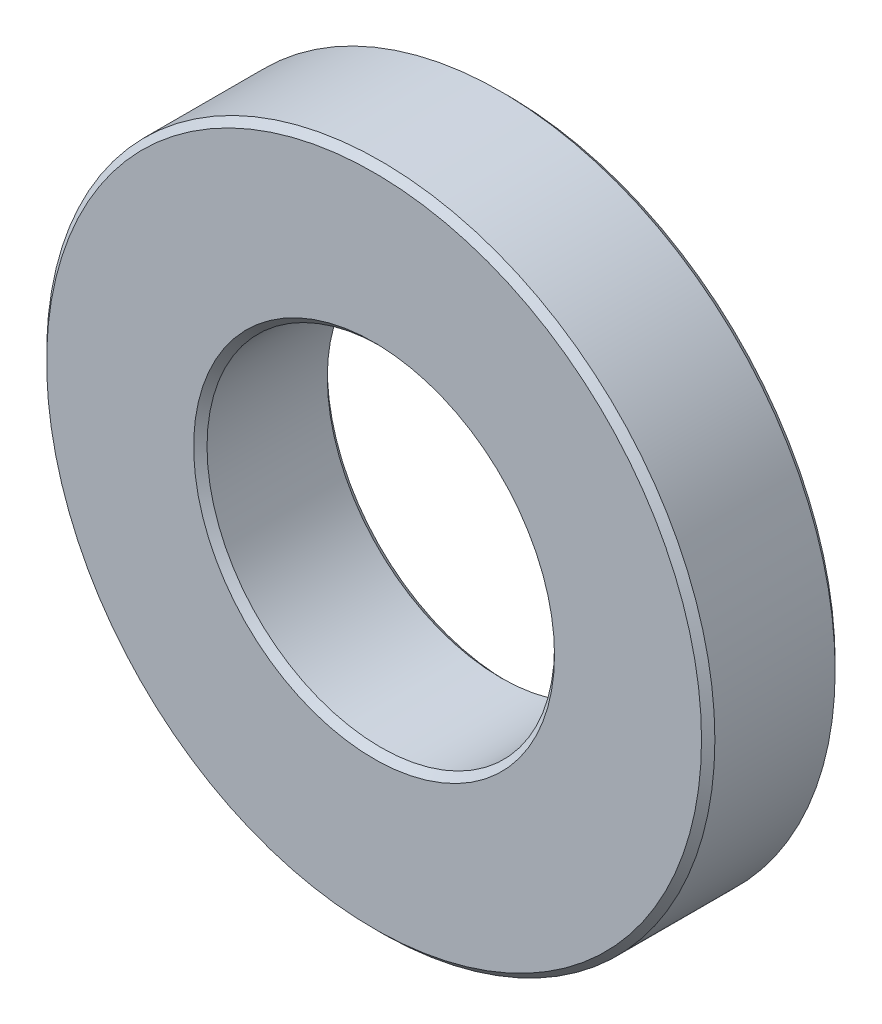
ISO-10303-21;
HEADER;
FILE_DESCRIPTION(('STEP AP214'),'2;1');
FILE_NAME('part.step','',(''),(''),'','','');
FILE_SCHEMA(('AUTOMOTIVE_DESIGN { 1 0 10303 214 1 1 1 1 }'));
ENDSEC;
DATA;
#1=APPLICATION_CONTEXT('core data for automotive mechanical design processes');
#2=APPLICATION_PROTOCOL_DEFINITION('international standard','automotive_design',2000,#1);
#3=PRODUCT_CONTEXT('',#1,'mechanical');
#4=PRODUCT('Part','Part','',(#3));
#5=PRODUCT_RELATED_PRODUCT_CATEGORY('part','',(#4));
#6=PRODUCT_DEFINITION_FORMATION('','',#4);
#7=PRODUCT_DEFINITION_CONTEXT('part definition',#1,'design');
#8=PRODUCT_DEFINITION('design','',#6,#7);
#9=PRODUCT_DEFINITION_SHAPE('','',#8);
#10=(LENGTH_UNIT() NAMED_UNIT(*) SI_UNIT(.MILLI.,.METRE.));
#11=(NAMED_UNIT(*) PLANE_ANGLE_UNIT() SI_UNIT($,.RADIAN.));
#12=(NAMED_UNIT(*) SI_UNIT($,.STERADIAN.) SOLID_ANGLE_UNIT());
#13=UNCERTAINTY_MEASURE_WITH_UNIT(LENGTH_MEASURE(1.E-05),#10,'distance_accuracy_value','');
#14=(GEOMETRIC_REPRESENTATION_CONTEXT(3) GLOBAL_UNCERTAINTY_ASSIGNED_CONTEXT((#13)) GLOBAL_UNIT_ASSIGNED_CONTEXT((#10,
#11,#12)) REPRESENTATION_CONTEXT('',''));
#15=CARTESIAN_POINT('',(0.,0.,0.));
#16=DIRECTION('',(0.,0.,1.));
#17=DIRECTION('',(1.,0.,0.));
#18=AXIS2_PLACEMENT_3D('',#15,#16,#17);
#19=CARTESIAN_POINT('',(0.,0.,1.));
#20=DIRECTION('',(0.,0.,1.));
#21=DIRECTION('',(1.,0.,0.));
#22=AXIS2_PLACEMENT_3D('',#19,#20,#21);
#23=PLANE('',#22);
#24=CARTESIAN_POINT('',(0.,0.,1.));
#25=DIRECTION('',(0.,0.,1.));
#26=DIRECTION('',(1.,0.,0.));
#27=AXIS2_PLACEMENT_3D('',#24,#25,#26);
#28=CIRCLE('',#27,2.7);
#29=CARTESIAN_POINT('',(2.7,0.,1.));
#30=VERTEX_POINT('',#29);
#31=EDGE_CURVE('E10',#30,#30,#28,.F.);
#32=ORIENTED_EDGE('',*,*,#31,.T.);
#33=EDGE_LOOP('',(#32));
#34=FACE_BOUND('',#33,.T.);
#35=CARTESIAN_POINT('',(0.,0.,1.));
#36=DIRECTION('',(0.,0.,1.));
#37=DIRECTION('',(1.,0.,0.));
#38=AXIS2_PLACEMENT_3D('',#35,#36,#37);
#39=CIRCLE('',#38,4.9);
#40=CARTESIAN_POINT('',(4.9,0.,1.));
#41=VERTEX_POINT('',#40);
#42=EDGE_CURVE('E45',#41,#41,#39,.T.);
#43=ORIENTED_EDGE('',*,*,#42,.T.);
#44=EDGE_LOOP('',(#43));
#45=FACE_BOUND('',#44,.T.);
#46=ADVANCED_FACE('F37',(#34,#45),#23,.T.);
#47=CARTESIAN_POINT('',(0.,0.,-1.));
#48=DIRECTION('',(0.,0.,1.));
#49=DIRECTION('',(1.,0.,0.));
#50=AXIS2_PLACEMENT_3D('',#47,#48,#49);
#51=PLANE('',#50);
#52=CARTESIAN_POINT('',(0.,0.,-1.));
#53=DIRECTION('',(0.,0.,1.));
#54=DIRECTION('',(1.,0.,0.));
#55=AXIS2_PLACEMENT_3D('',#52,#53,#54);
#56=CIRCLE('',#55,4.9);
#57=CARTESIAN_POINT('',(4.9,0.,-1.));
#58=VERTEX_POINT('',#57);
#59=EDGE_CURVE('E63',#58,#58,#56,.F.);
#60=ORIENTED_EDGE('',*,*,#59,.T.);
#61=EDGE_LOOP('',(#60));
#62=FACE_BOUND('',#61,.T.);
#63=CARTESIAN_POINT('',(0.,0.,-1.));
#64=DIRECTION('',(0.,0.,1.));
#65=DIRECTION('',(1.,0.,0.));
#66=AXIS2_PLACEMENT_3D('',#63,#64,#65);
#67=CIRCLE('',#66,2.7);
#68=CARTESIAN_POINT('',(2.7,0.,-1.));
#69=VERTEX_POINT('',#68);
#70=EDGE_CURVE('E67',#69,#69,#67,.T.);
#71=ORIENTED_EDGE('',*,*,#70,.T.);
#72=EDGE_LOOP('',(#71));
#73=FACE_BOUND('',#72,.T.);
#74=ADVANCED_FACE('F89',(#62,#73),#51,.F.);
#75=CARTESIAN_POINT('',(0.,0.,1.));
#76=DIRECTION('',(0.,0.,-1.));
#77=DIRECTION('',(-1.,0.,0.));
#78=AXIS2_PLACEMENT_3D('',#75,#76,#77);
#79=CYLINDRICAL_SURFACE('',#78,5.);
#80=CARTESIAN_POINT('',(0.,0.,-0.899999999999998));
#81=DIRECTION('',(0.,0.,1.));
#82=DIRECTION('',(1.,0.,0.));
#83=AXIS2_PLACEMENT_3D('',#80,#81,#82);
#84=CIRCLE('',#83,5.);
#85=CARTESIAN_POINT('',(5.,0.,-0.899999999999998));
#86=VERTEX_POINT('',#85);
#87=EDGE_CURVE('E70',#86,#86,#84,.T.);
#88=ORIENTED_EDGE('',*,*,#87,.T.);
#89=EDGE_LOOP('',(#88));
#90=FACE_BOUND('',#89,.T.);
#91=CARTESIAN_POINT('',(0.,0.,0.900000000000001));
#92=DIRECTION('',(0.,0.,1.));
#93=DIRECTION('',(1.,0.,0.));
#94=AXIS2_PLACEMENT_3D('',#91,#92,#93);
#95=CIRCLE('',#94,5.);
#96=CARTESIAN_POINT('',(5.,0.,0.900000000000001));
#97=VERTEX_POINT('',#96);
#98=EDGE_CURVE('E73',#97,#97,#95,.F.);
#99=ORIENTED_EDGE('',*,*,#98,.T.);
#100=EDGE_LOOP('',(#99));
#101=FACE_BOUND('',#100,.T.);
#102=ADVANCED_FACE('F78',(#90,#101),#79,.T.);
#103=CARTESIAN_POINT('',(0.,0.,1.));
#104=DIRECTION('',(0.,0.,-1.));
#105=DIRECTION('',(-1.,0.,0.));
#106=AXIS2_PLACEMENT_3D('',#103,#104,#105);
#107=CYLINDRICAL_SURFACE('',#106,2.6);
#108=CARTESIAN_POINT('',(0.,0.,-0.900000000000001));
#109=DIRECTION('',(0.,0.,1.));
#110=DIRECTION('',(1.,0.,0.));
#111=AXIS2_PLACEMENT_3D('',#108,#109,#110);
#112=CIRCLE('',#111,2.6);
#113=CARTESIAN_POINT('',(2.6,0.,-0.900000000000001));
#114=VERTEX_POINT('',#113);
#115=EDGE_CURVE('E51',#114,#114,#112,.F.);
#116=ORIENTED_EDGE('',*,*,#115,.T.);
#117=EDGE_LOOP('',(#116));
#118=FACE_BOUND('',#117,.T.);
#119=CARTESIAN_POINT('',(0.,0.,0.899999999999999));
#120=DIRECTION('',(0.,0.,1.));
#121=DIRECTION('',(1.,0.,0.));
#122=AXIS2_PLACEMENT_3D('',#119,#120,#121);
#123=CIRCLE('',#122,2.6);
#124=CARTESIAN_POINT('',(2.6,0.,0.899999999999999));
#125=VERTEX_POINT('',#124);
#126=EDGE_CURVE('E57',#125,#125,#123,.T.);
#127=ORIENTED_EDGE('',*,*,#126,.T.);
#128=EDGE_LOOP('',(#127));
#129=FACE_BOUND('',#128,.T.);
#130=ADVANCED_FACE('F97',(#118,#129),#107,.F.);
#131=CARTESIAN_POINT('',(0.,0.,-0.899999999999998));
#132=DIRECTION('',(0.,0.,1.));
#133=DIRECTION('',(1.,0.,0.));
#134=AXIS2_PLACEMENT_3D('',#131,#132,#133);
#135=CONICAL_SURFACE('',#134,5.,0.785398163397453);
#136=ORIENTED_EDGE('',*,*,#59,.F.);
#137=EDGE_LOOP('',(#136));
#138=FACE_BOUND('',#137,.T.);
#139=ORIENTED_EDGE('',*,*,#87,.F.);
#140=EDGE_LOOP('',(#139));
#141=FACE_BOUND('',#140,.T.);
#142=ADVANCED_FACE('F102',(#138,#141),#135,.T.);
#143=CARTESIAN_POINT('',(0.,0.,-1.));
#144=DIRECTION('',(0.,0.,-1.));
#145=DIRECTION('',(-1.,0.,0.));
#146=AXIS2_PLACEMENT_3D('',#143,#144,#145);
#147=CONICAL_SURFACE('',#146,2.7,0.78539816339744);
#148=ORIENTED_EDGE('',*,*,#115,.F.);
#149=EDGE_LOOP('',(#148));
#150=FACE_BOUND('',#149,.T.);
#151=ORIENTED_EDGE('',*,*,#70,.F.);
#152=EDGE_LOOP('',(#151));
#153=FACE_BOUND('',#152,.T.);
#154=ADVANCED_FACE('F86',(#150,#153),#147,.F.);
#155=CARTESIAN_POINT('',(0.,0.,0.899999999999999));
#156=DIRECTION('',(0.,0.,1.));
#157=DIRECTION('',(1.,0.,0.));
#158=AXIS2_PLACEMENT_3D('',#155,#156,#157);
#159=CONICAL_SURFACE('',#158,2.6,0.785398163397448);
#160=ORIENTED_EDGE('',*,*,#31,.F.);
#161=EDGE_LOOP('',(#160));
#162=FACE_BOUND('',#161,.T.);
#163=ORIENTED_EDGE('',*,*,#126,.F.);
#164=EDGE_LOOP('',(#163));
#165=FACE_BOUND('',#164,.T.);
#166=ADVANCED_FACE('F82',(#162,#165),#159,.F.);
#167=CARTESIAN_POINT('',(0.,0.,1.));
#168=DIRECTION('',(0.,0.,-1.));
#169=DIRECTION('',(-1.,0.,0.));
#170=AXIS2_PLACEMENT_3D('',#167,#168,#169);
#171=CONICAL_SURFACE('',#170,4.9,0.785398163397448);
#172=ORIENTED_EDGE('',*,*,#98,.F.);
#173=EDGE_LOOP('',(#172));
#174=FACE_BOUND('',#173,.T.);
#175=ORIENTED_EDGE('',*,*,#42,.F.);
#176=EDGE_LOOP('',(#175));
#177=FACE_BOUND('',#176,.T.);
#178=ADVANCED_FACE('F39',(#174,#177),#171,.T.);
#179=CLOSED_SHELL('',(#46,#74,#102,#130,#142,#154,#166,#178));
#180=MANIFOLD_SOLID_BREP('B2',#179);
#181=ADVANCED_BREP_SHAPE_REPRESENTATION('',(#18,#180),#14);
#182=SHAPE_DEFINITION_REPRESENTATION(#9,#181);
ENDSEC;
END-ISO-10303-21;
